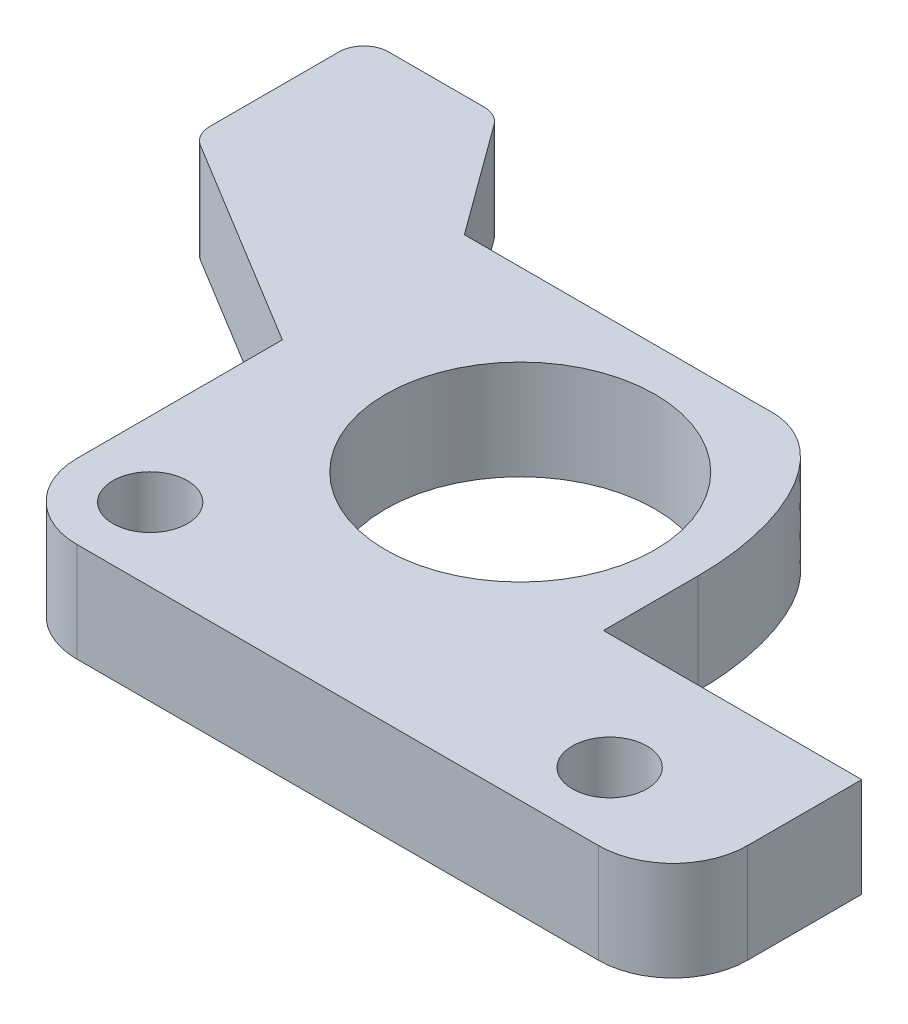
ISO-10303-21;
HEADER;
FILE_DESCRIPTION(('STEP AP214'),'2;1');
FILE_NAME('part.step','',(''),(''),'','','');
FILE_SCHEMA(('AUTOMOTIVE_DESIGN { 1 0 10303 214 1 1 1 1 }'));
ENDSEC;
DATA;
#1=APPLICATION_CONTEXT('core data for automotive mechanical design processes');
#2=APPLICATION_PROTOCOL_DEFINITION('international standard','automotive_design',2000,#1);
#3=PRODUCT_CONTEXT('',#1,'mechanical');
#4=PRODUCT('Part','Part','',(#3));
#5=PRODUCT_RELATED_PRODUCT_CATEGORY('part','',(#4));
#6=PRODUCT_DEFINITION_FORMATION('','',#4);
#7=PRODUCT_DEFINITION_CONTEXT('part definition',#1,'design');
#8=PRODUCT_DEFINITION('design','',#6,#7);
#9=PRODUCT_DEFINITION_SHAPE('','',#8);
#10=(LENGTH_UNIT() NAMED_UNIT(*) SI_UNIT(.MILLI.,.METRE.));
#11=(NAMED_UNIT(*) PLANE_ANGLE_UNIT() SI_UNIT($,.RADIAN.));
#12=(NAMED_UNIT(*) SI_UNIT($,.STERADIAN.) SOLID_ANGLE_UNIT());
#13=UNCERTAINTY_MEASURE_WITH_UNIT(LENGTH_MEASURE(1.E-05),#10,'distance_accuracy_value','');
#14=(GEOMETRIC_REPRESENTATION_CONTEXT(3) GLOBAL_UNCERTAINTY_ASSIGNED_CONTEXT((#13)) GLOBAL_UNIT_ASSIGNED_CONTEXT((#10,
#11,#12)) REPRESENTATION_CONTEXT('',''));
#15=CARTESIAN_POINT('',(0.,0.,0.));
#16=DIRECTION('',(0.,0.,1.));
#17=DIRECTION('',(1.,0.,0.));
#18=AXIS2_PLACEMENT_3D('',#15,#16,#17);
#19=CARTESIAN_POINT('',(-17.55,-2.,-7.725));
#20=DIRECTION('',(0.,1.,0.));
#21=DIRECTION('',(0.,0.,1.));
#22=AXIS2_PLACEMENT_3D('',#19,#20,#21);
#23=CYLINDRICAL_SURFACE('',#22,1.);
#24=DIRECTION('',(0.,1.,0.));
#25=VECTOR('',#24,1.);
#26=CARTESIAN_POINT('',(-16.7424340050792,-2.,-8.31477721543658));
#27=LINE('',#26,#25);
#28=CARTESIAN_POINT('',(-16.7424340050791,-2.,-8.31477721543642));
#29=VERTEX_POINT('',#28);
#30=CARTESIAN_POINT('',(-16.7424340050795,2.,-8.3147772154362));
#31=VERTEX_POINT('',#30);
#32=EDGE_CURVE('E131',#29,#31,#27,.T.);
#33=ORIENTED_EDGE('',*,*,#32,.F.);
#34=CARTESIAN_POINT('',(-17.55,-2.,-7.725));
#35=DIRECTION('',(0.,1.,0.));
#36=DIRECTION('',(0.,0.,1.));
#37=AXIS2_PLACEMENT_3D('',#34,#35,#36);
#38=CIRCLE('',#37,1.);
#39=CARTESIAN_POINT('',(-17.55,-2.,-8.725));
#40=VERTEX_POINT('',#39);
#41=EDGE_CURVE('E309',#29,#40,#38,.T.);
#42=ORIENTED_EDGE('',*,*,#41,.T.);
#43=DIRECTION('',(0.,1.,0.));
#44=VECTOR('',#43,1.);
#45=CARTESIAN_POINT('',(-17.55,-2.,-8.725));
#46=LINE('',#45,#44);
#47=CARTESIAN_POINT('',(-17.55,2.,-8.725));
#48=VERTEX_POINT('',#47);
#49=EDGE_CURVE('E134',#48,#40,#46,.F.);
#50=ORIENTED_EDGE('',*,*,#49,.F.);
#51=CARTESIAN_POINT('',(-17.55,2.,-7.725));
#52=DIRECTION('',(0.,1.,0.));
#53=DIRECTION('',(0.,0.,1.));
#54=AXIS2_PLACEMENT_3D('',#51,#52,#53);
#55=CIRCLE('',#54,1.);
#56=EDGE_CURVE('E20',#48,#31,#55,.F.);
#57=ORIENTED_EDGE('',*,*,#56,.T.);
#58=EDGE_LOOP('',(#33,#42,#50,#57));
#59=FACE_BOUND('',#58,.T.);
#60=ADVANCED_FACE('F17',(#59),#23,.T.);
#61=CARTESIAN_POINT('',(-21.4,-2.,-7.725));
#62=DIRECTION('',(0.,1.,0.));
#63=DIRECTION('',(0.,0.,1.));
#64=AXIS2_PLACEMENT_3D('',#61,#62,#63);
#65=CYLINDRICAL_SURFACE('',#64,1.);
#66=DIRECTION('',(0.,1.,0.));
#67=VECTOR('',#66,1.);
#68=CARTESIAN_POINT('',(-21.4,-2.,-8.725));
#69=LINE('',#68,#67);
#70=CARTESIAN_POINT('',(-21.4,-2.,-8.725));
#71=VERTEX_POINT('',#70);
#72=CARTESIAN_POINT('',(-21.4,2.,-8.725));
#73=VERTEX_POINT('',#72);
#74=EDGE_CURVE('E219',#71,#73,#69,.T.);
#75=ORIENTED_EDGE('',*,*,#74,.F.);
#76=CARTESIAN_POINT('',(-21.4,-2.,-7.725));
#77=DIRECTION('',(0.,1.,0.));
#78=DIRECTION('',(0.,0.,1.));
#79=AXIS2_PLACEMENT_3D('',#76,#77,#78);
#80=CIRCLE('',#79,1.);
#81=CARTESIAN_POINT('',(-22.4,-2.,-7.725));
#82=VERTEX_POINT('',#81);
#83=EDGE_CURVE('E382',#71,#82,#80,.T.);
#84=ORIENTED_EDGE('',*,*,#83,.T.);
#85=DIRECTION('',(0.,1.,0.));
#86=VECTOR('',#85,1.);
#87=CARTESIAN_POINT('',(-22.4,-2.,-7.725));
#88=LINE('',#87,#86);
#89=CARTESIAN_POINT('',(-22.4,2.,-7.725));
#90=VERTEX_POINT('',#89);
#91=EDGE_CURVE('E211',#90,#82,#88,.F.);
#92=ORIENTED_EDGE('',*,*,#91,.F.);
#93=CARTESIAN_POINT('',(-21.4,2.,-7.725));
#94=DIRECTION('',(0.,1.,0.));
#95=DIRECTION('',(0.,0.,1.));
#96=AXIS2_PLACEMENT_3D('',#93,#94,#95);
#97=CIRCLE('',#96,1.);
#98=EDGE_CURVE('E136',#90,#73,#97,.F.);
#99=ORIENTED_EDGE('',*,*,#98,.T.);
#100=EDGE_LOOP('',(#75,#84,#92,#99));
#101=FACE_BOUND('',#100,.T.);
#102=ADVANCED_FACE('F393',(#101),#65,.T.);
#103=CARTESIAN_POINT('',(-21.4,-2.,-2.525));
#104=DIRECTION('',(0.,1.,0.));
#105=DIRECTION('',(0.,0.,1.));
#106=AXIS2_PLACEMENT_3D('',#103,#104,#105);
#107=CYLINDRICAL_SURFACE('',#106,1.);
#108=DIRECTION('',(0.,1.,0.));
#109=VECTOR('',#108,1.);
#110=CARTESIAN_POINT('',(-22.4,-2.,-2.525));
#111=LINE('',#110,#109);
#112=CARTESIAN_POINT('',(-22.4,-2.,-2.525));
#113=VERTEX_POINT('',#112);
#114=CARTESIAN_POINT('',(-22.4,2.,-2.525));
#115=VERTEX_POINT('',#114);
#116=EDGE_CURVE('E214',#113,#115,#111,.T.);
#117=ORIENTED_EDGE('',*,*,#116,.F.);
#118=CARTESIAN_POINT('',(-21.4,-2.,-2.525));
#119=DIRECTION('',(0.,1.,0.));
#120=DIRECTION('',(0.,0.,1.));
#121=AXIS2_PLACEMENT_3D('',#118,#119,#120);
#122=CIRCLE('',#121,1.);
#123=CARTESIAN_POINT('',(-21.9199925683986,-2.,-1.67082921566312));
#124=VERTEX_POINT('',#123);
#125=EDGE_CURVE('E338',#113,#124,#122,.T.);
#126=ORIENTED_EDGE('',*,*,#125,.T.);
#127=DIRECTION('',(0.,1.,0.));
#128=VECTOR('',#127,1.);
#129=CARTESIAN_POINT('',(-21.9199925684,-2.,-1.670829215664));
#130=LINE('',#129,#128);
#131=CARTESIAN_POINT('',(-21.9199925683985,2.,-1.67082921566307));
#132=VERTEX_POINT('',#131);
#133=EDGE_CURVE('E207',#132,#124,#130,.F.);
#134=ORIENTED_EDGE('',*,*,#133,.F.);
#135=CARTESIAN_POINT('',(-21.4,2.,-2.525));
#136=DIRECTION('',(0.,1.,0.));
#137=DIRECTION('',(0.,0.,1.));
#138=AXIS2_PLACEMENT_3D('',#135,#136,#137);
#139=CIRCLE('',#138,1.);
#140=EDGE_CURVE('E370',#132,#115,#139,.F.);
#141=ORIENTED_EDGE('',*,*,#140,.T.);
#142=EDGE_LOOP('',(#117,#126,#134,#141));
#143=FACE_BOUND('',#142,.T.);
#144=ADVANCED_FACE('F378',(#143),#107,.T.);
#145=CARTESIAN_POINT('',(0.,-2.,0.));
#146=DIRECTION('',(0.,1.,0.));
#147=DIRECTION('',(0.,0.,1.));
#148=AXIS2_PLACEMENT_3D('',#145,#146,#147);
#149=PLANE('',#148);
#150=CARTESIAN_POINT('',(-4.1,-2.,3.275));
#151=DIRECTION('',(0.,1.,0.));
#152=DIRECTION('',(0.,0.,1.));
#153=AXIS2_PLACEMENT_3D('',#150,#151,#152);
#154=CIRCLE('',#153,5.425);
#155=CARTESIAN_POINT('',(-4.1,-2.,8.7));
#156=VERTEX_POINT('',#155);
#157=EDGE_CURVE('E169',#156,#156,#154,.T.);
#158=ORIENTED_EDGE('',*,*,#157,.T.);
#159=EDGE_LOOP('',(#158));
#160=FACE_BOUND('',#159,.T.);
#161=CARTESIAN_POINT('',(-10.5,-2.,11.775));
#162=DIRECTION('',(0.,1.,0.));
#163=DIRECTION('',(0.,0.,1.));
#164=AXIS2_PLACEMENT_3D('',#161,#162,#163);
#165=CIRCLE('',#164,1.5);
#166=CARTESIAN_POINT('',(-10.5,-2.,13.275));
#167=VERTEX_POINT('',#166);
#168=EDGE_CURVE('E554',#167,#167,#165,.T.);
#169=ORIENTED_EDGE('',*,*,#168,.T.);
#170=EDGE_LOOP('',(#169));
#171=FACE_BOUND('',#170,.T.);
#172=CARTESIAN_POINT('',(8.,-2.,11.775));
#173=DIRECTION('',(0.,1.,0.));
#174=DIRECTION('',(0.,0.,1.));
#175=AXIS2_PLACEMENT_3D('',#172,#173,#174);
#176=CIRCLE('',#175,1.5);
#177=CARTESIAN_POINT('',(8.,-2.,13.275));
#178=VERTEX_POINT('',#177);
#179=EDGE_CURVE('E343',#178,#178,#176,.T.);
#180=ORIENTED_EDGE('',*,*,#179,.T.);
#181=EDGE_LOOP('',(#180));
#182=FACE_BOUND('',#181,.T.);
#183=CARTESIAN_POINT('',(10.5,-2.,11.725));
#184=DIRECTION('',(0.,1.,0.));
#185=DIRECTION('',(0.,0.,1.));
#186=AXIS2_PLACEMENT_3D('',#183,#184,#185);
#187=CIRCLE('',#186,3.);
#188=CARTESIAN_POINT('',(10.5,-2.,14.725));
#189=VERTEX_POINT('',#188);
#190=CARTESIAN_POINT('',(13.5,-2.,11.725));
#191=VERTEX_POINT('',#190);
#192=EDGE_CURVE('E176',#189,#191,#187,.T.);
#193=ORIENTED_EDGE('',*,*,#192,.F.);
#194=DIRECTION('',(1.,0.,0.));
#195=VECTOR('',#194,1.);
#196=CARTESIAN_POINT('',(-10.5,-2.,14.725));
#197=LINE('',#196,#195);
#198=CARTESIAN_POINT('',(-10.5,-2.,14.725));
#199=VERTEX_POINT('',#198);
#200=EDGE_CURVE('E192',#199,#189,#197,.T.);
#201=ORIENTED_EDGE('',*,*,#200,.F.);
#202=CARTESIAN_POINT('',(-10.5,-2.,11.725));
#203=DIRECTION('',(0.,1.,0.));
#204=DIRECTION('',(0.,0.,1.));
#205=AXIS2_PLACEMENT_3D('',#202,#203,#204);
#206=CIRCLE('',#205,3.);
#207=CARTESIAN_POINT('',(-13.5,-2.,11.725));
#208=VERTEX_POINT('',#207);
#209=EDGE_CURVE('E196',#208,#199,#206,.T.);
#210=ORIENTED_EDGE('',*,*,#209,.F.);
#211=DIRECTION('',(0.,0.,1.));
#212=VECTOR('',#211,1.);
#213=CARTESIAN_POINT('',(-13.5,-2.,3.455));
#214=LINE('',#213,#212);
#215=CARTESIAN_POINT('',(-13.5000000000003,-2.,3.45500000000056));
#216=VERTEX_POINT('',#215);
#217=EDGE_CURVE('E200',#216,#208,#214,.T.);
#218=ORIENTED_EDGE('',*,*,#217,.F.);
#219=DIRECTION('',(0.854170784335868,0.,0.519992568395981));
#220=VECTOR('',#219,1.);
#221=CARTESIAN_POINT('',(-21.9199925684,-2.,-1.670829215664));
#222=LINE('',#221,#220);
#223=EDGE_CURVE('E204',#124,#216,#222,.T.);
#224=ORIENTED_EDGE('',*,*,#223,.F.);
#225=ORIENTED_EDGE('',*,*,#125,.F.);
#226=DIRECTION('',(0.,0.,1.));
#227=VECTOR('',#226,1.);
#228=CARTESIAN_POINT('',(-22.4,-2.,-7.725));
#229=LINE('',#228,#227);
#230=EDGE_CURVE('E210',#82,#113,#229,.T.);
#231=ORIENTED_EDGE('',*,*,#230,.F.);
#232=ORIENTED_EDGE('',*,*,#83,.F.);
#233=DIRECTION('',(-1.,0.,0.));
#234=VECTOR('',#233,1.);
#235=CARTESIAN_POINT('',(-17.55,-2.,-8.725));
#236=LINE('',#235,#234);
#237=EDGE_CURVE('E217',#40,#71,#236,.T.);
#238=ORIENTED_EDGE('',*,*,#237,.F.);
#239=ORIENTED_EDGE('',*,*,#41,.F.);
#240=DIRECTION('',(-0.589777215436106,0.,-0.807565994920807));
#241=VECTOR('',#240,1.);
#242=CARTESIAN_POINT('',(-13.5,-2.,-3.875));
#243=LINE('',#242,#241);
#244=CARTESIAN_POINT('',(-13.5,-2.,-3.875));
#245=VERTEX_POINT('',#244);
#246=EDGE_CURVE('E145',#245,#29,#243,.T.);
#247=ORIENTED_EDGE('',*,*,#246,.F.);
#248=DIRECTION('',(-1.,0.,0.));
#249=VECTOR('',#248,1.);
#250=CARTESIAN_POINT('',(-1.1,-2.,-3.875));
#251=LINE('',#250,#249);
#252=CARTESIAN_POINT('',(-1.10000021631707,-2.,-3.87509362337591));
#253=VERTEX_POINT('',#252);
#254=EDGE_CURVE('E147',#253,#245,#251,.T.);
#255=ORIENTED_EDGE('',*,*,#254,.F.);
#256=CARTESIAN_POINT('',(-1.10000043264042,-2.,-3.87518724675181));
#257=CARTESIAN_POINT('',(-1.06274442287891,-2.,-3.87528070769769));
#258=CARTESIAN_POINT('',(-1.02548448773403,-2.,-3.87452258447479));
#259=CARTESIAN_POINT('',(-0.95104595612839,-2.,-3.8712746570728));
#260=CARTESIAN_POINT('',(-0.913867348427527,-2.,-3.86878510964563));
#261=CARTESIAN_POINT('',(-0.839712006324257,-2.,-3.86204972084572));
#262=CARTESIAN_POINT('',(-0.802735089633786,-2.,-3.85780589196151));
#263=CARTESIAN_POINT('',(-0.729020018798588,-2.,-3.84759505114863));
#264=CARTESIAN_POINT('',(-0.692281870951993,-2.,-3.84162799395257));
#265=CARTESIAN_POINT('',(-0.619405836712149,-2.,-3.82812449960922));
#266=CARTESIAN_POINT('',(-0.583265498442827,-2.,-3.82060123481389));
#267=CARTESIAN_POINT('',(-0.511324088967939,-2.,-3.8040875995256));
#268=CARTESIAN_POINT('',(-0.475523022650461,-2.,-3.79509720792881));
#269=CARTESIAN_POINT('',(-0.368705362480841,-2.,-3.76590657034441));
#270=CARTESIAN_POINT('',(-0.298280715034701,-2.,-3.74348805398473));
#271=CARTESIAN_POINT('',(-0.159767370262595,-2.,-3.69318046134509));
#272=CARTESIAN_POINT('',(-0.091670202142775,-2.,-3.66531444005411));
#273=CARTESIAN_POINT('',(0.0423080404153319,-2.,-3.60472016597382));
#274=CARTESIAN_POINT('',(0.108189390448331,-2.,-3.57199252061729));
#275=CARTESIAN_POINT('',(0.237587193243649,-2.,-3.50186612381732));
#276=CARTESIAN_POINT('',(0.301098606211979,-2.,-3.46445808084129));
#277=CARTESIAN_POINT('',(0.425433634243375,-2.,-3.38541570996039));
#278=CARTESIAN_POINT('',(0.486256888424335,-2.,-3.34378081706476));
#279=CARTESIAN_POINT('',(0.643423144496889,-2.,-3.2287346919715));
#280=CARTESIAN_POINT('',(0.737427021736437,-2.,-3.15212099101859));
#281=CARTESIAN_POINT('',(0.918564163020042,-2.,-2.99114968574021));
#282=CARTESIAN_POINT('',(1.00569283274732,-2.,-2.90678698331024));
#283=CARTESIAN_POINT('',(1.17329028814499,-2.,-2.7313428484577));
#284=CARTESIAN_POINT('',(1.25374403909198,-2.,-2.64024707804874));
#285=CARTESIAN_POINT('',(1.40799057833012,-2.,-2.45265218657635));
#286=CARTESIAN_POINT('',(1.48178439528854,-2.,-2.35615390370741));
#287=CARTESIAN_POINT('',(1.66654289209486,-2.,-2.09822614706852));
#288=CARTESIAN_POINT('',(1.77257859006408,-2.,-1.93324018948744));
#289=CARTESIAN_POINT('',(1.92051166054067,-2.,-1.67936265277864));
#290=CARTESIAN_POINT('',(1.96798794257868,-2.,-1.59363074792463));
#291=CARTESIAN_POINT('',(2.05946658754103,-2.,-1.42033094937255));
#292=CARTESIAN_POINT('',(2.10346902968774,-2.,-1.33276309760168));
#293=CARTESIAN_POINT('',(2.2308021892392,-2.,-1.06703783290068));
#294=CARTESIAN_POINT('',(2.30911471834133,-2.,-0.886456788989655));
#295=CARTESIAN_POINT('',(2.4532245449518,-2.,-0.520457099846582));
#296=CARTESIAN_POINT('',(2.51902358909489,-2.,-0.335039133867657));
#297=CARTESIAN_POINT('',(2.63937629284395,-2.,0.0402199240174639));
#298=CARTESIAN_POINT('',(2.69388396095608,-2.,0.23007573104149));
#299=CARTESIAN_POINT('',(2.76763567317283,-2.,0.516929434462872));
#300=CARTESIAN_POINT('',(2.79089014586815,-2.,0.612920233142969));
#301=CARTESIAN_POINT('',(2.83485992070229,-2.,0.805484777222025));
#302=CARTESIAN_POINT('',(2.85557521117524,-2.,0.902058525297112));
#303=CARTESIAN_POINT('',(2.89449673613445,-2.,1.09574987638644));
#304=CARTESIAN_POINT('',(2.91270197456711,-2.,1.19286767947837));
#305=CARTESIAN_POINT('',(2.94655143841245,-2.,1.38754543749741));
#306=CARTESIAN_POINT('',(2.9621956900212,-2.,1.48510538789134));
#307=CARTESIAN_POINT('',(3.00481682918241,-2.,1.77519348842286));
#308=CARTESIAN_POINT('',(3.02811292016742,-2.,1.96827571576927));
#309=CARTESIAN_POINT('',(3.06492199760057,-2.,2.35523313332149));
#310=CARTESIAN_POINT('',(3.07844093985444,-2.,2.54910776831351));
#311=CARTESIAN_POINT('',(3.09614751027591,-2.,2.93699723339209));
#312=CARTESIAN_POINT('',(3.10034899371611,-2.,3.13101142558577));
#313=CARTESIAN_POINT('',(3.10012520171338,-2.,3.32500013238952));
#314=B_SPLINE_CURVE_WITH_KNOTS('',3,(#256,#257,#258,#259,#260,#261,#262,#263,#264,#265,#266,
#267,#268,#269,#270,#271,#272,#273,#274,#275,#276,#277,#278,#279,#280,#281,#282,#283,#284,#285,
#286,#287,#288,#289,#290,#291,#292,#293,#294,#295,#296,#297,#298,#299,#300,#301,#302,#303,#304,
#305,#306,#307,#308,#309,#310,#311,#312,#313),.UNSPECIFIED.,.F.,.F.,(4,2,2,2,2,2,2,2,2,2,2,2,2,
2,2,2,2,2,2,2,2,2,2,2,2,2,2,2,4),(0.,0.111761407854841,0.223506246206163,0.33512324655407,
0.446743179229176,0.55745437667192,0.668167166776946,0.889612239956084,1.11013964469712,
1.33063951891,1.5515842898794,1.77255863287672,2.13577978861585,2.49924164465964,
2.86350111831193,3.22770423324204,3.81506331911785,4.10900491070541,4.40293979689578,
4.99287384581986,5.58272549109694,6.17493439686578,6.47120927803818,6.7674855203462,
7.06387899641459,7.36026944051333,7.94343676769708,8.52624855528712,9.10819310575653),.UNSPECIFIED.);
#315=CARTESIAN_POINT('',(3.10006260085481,-2.,3.32500006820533));
#316=VERTEX_POINT('',#315);
#317=EDGE_CURVE('E299',#253,#316,#314,.T.);
#318=ORIENTED_EDGE('',*,*,#317,.T.);
#319=DIRECTION('',(0.,0.,-1.));
#320=VECTOR('',#319,1.);
#321=CARTESIAN_POINT('',(3.1,-2.,7.125));
#322=LINE('',#321,#320);
#323=CARTESIAN_POINT('',(3.1,-2.,7.125));
#324=VERTEX_POINT('',#323);
#325=EDGE_CURVE('E336',#324,#316,#322,.T.);
#326=ORIENTED_EDGE('',*,*,#325,.F.);
#327=DIRECTION('',(-1.,0.,0.));
#328=VECTOR('',#327,1.);
#329=CARTESIAN_POINT('',(13.5,-2.,7.125));
#330=LINE('',#329,#328);
#331=CARTESIAN_POINT('',(13.5,-2.,7.125));
#332=VERTEX_POINT('',#331);
#333=EDGE_CURVE('E185',#332,#324,#330,.T.);
#334=ORIENTED_EDGE('',*,*,#333,.F.);
#335=DIRECTION('',(0.,0.,-1.));
#336=VECTOR('',#335,1.);
#337=CARTESIAN_POINT('',(13.5,-2.,11.725));
#338=LINE('',#337,#336);
#339=EDGE_CURVE('E175',#191,#332,#338,.T.);
#340=ORIENTED_EDGE('',*,*,#339,.F.);
#341=EDGE_LOOP('',(#193,#201,#210,#218,#224,#225,#231,#232,#238,#239,#247,#255,#318,#326,#334,#340));
#342=FACE_BOUND('',#341,.T.);
#343=ADVANCED_FACE('F307',(#160,#171,#182,#342),#149,.F.);
#344=CARTESIAN_POINT('',(3.1,-2.,7.125));
#345=DIRECTION('',(1.,0.,0.));
#346=DIRECTION('',(0.,0.,-1.));
#347=AXIS2_PLACEMENT_3D('',#344,#345,#346);
#348=PLANE('',#347);
#349=DIRECTION('',(0.,1.,0.));
#350=VECTOR('',#349,1.);
#351=CARTESIAN_POINT('',(3.1,-2.,7.125));
#352=LINE('',#351,#350);
#353=CARTESIAN_POINT('',(3.1,2.,7.125));
#354=VERTEX_POINT('',#353);
#355=EDGE_CURVE('E186',#324,#354,#352,.T.);
#356=ORIENTED_EDGE('',*,*,#355,.F.);
#357=ORIENTED_EDGE('',*,*,#325,.T.);
#358=CARTESIAN_POINT('',(3.10012520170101,2.,3.32500014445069));
#359=DIRECTION('',(0.,-1.,0.));
#360=VECTOR('',#359,1.);
#361=LINE('',#358,#360);
#362=CARTESIAN_POINT('',(3.10006260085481,2.,3.32500006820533));
#363=VERTEX_POINT('',#362);
#364=EDGE_CURVE('E276',#316,#363,#361,.F.);
#365=ORIENTED_EDGE('',*,*,#364,.T.);
#366=DIRECTION('',(0.,0.,1.));
#367=VECTOR('',#366,1.);
#368=CARTESIAN_POINT('',(3.1,2.,0.));
#369=LINE('',#368,#367);
#370=EDGE_CURVE('E166',#354,#363,#369,.F.);
#371=ORIENTED_EDGE('',*,*,#370,.F.);
#372=EDGE_LOOP('',(#356,#357,#365,#371));
#373=FACE_BOUND('',#372,.T.);
#374=ADVANCED_FACE('F240',(#373),#348,.T.);
#375=CARTESIAN_POINT('',(-1.231925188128,-2.,-3.871447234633));
#376=CARTESIAN_POINT('',(-0.9793425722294,-2.,-3.885054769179));
#377=CARTESIAN_POINT('',(-0.5480026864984,-2.,-3.835776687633));
#378=CARTESIAN_POINT('',(0.1671233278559,-2.,-3.5843346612));
#379=CARTESIAN_POINT('',(0.8789441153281,-2.,-3.08136538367));
#380=CARTESIAN_POINT('',(1.561201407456,-2.,-2.299661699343));
#381=CARTESIAN_POINT('',(2.109111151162,-2.,-1.378755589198));
#382=CARTESIAN_POINT('',(2.541363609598,-2.,-0.3380127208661));
#383=CARTESIAN_POINT('',(2.967081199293,-2.,1.205706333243));
#384=CARTESIAN_POINT('',(3.116472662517,-2.,2.539531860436));
#385=CARTESIAN_POINT('',(3.097927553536,-2.,3.551157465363));
#386=(BOUNDED_CURVE() B_SPLINE_CURVE(3,(#375,#376,#377,#378,#379,#380,#381,#382,#383,#384,#385),
.UNSPECIFIED.,.F.,.F.) B_SPLINE_CURVE_WITH_KNOTS((4,1,1,1,1,1,1,1,4),(0.,0.0625,0.125,0.25,
0.375,0.5,0.625,0.75,1.),
.UNSPECIFIED.) CURVE() GEOMETRIC_REPRESENTATION_ITEM() RATIONAL_B_SPLINE_CURVE((1.,1.,1.,1.,1.,
1.,1.,1.,1.,1.,1.)) REPRESENTATION_ITEM(''));
#387=DIRECTION('',(0.,1.,0.));
#388=VECTOR('',#387,1.);
#389=SURFACE_OF_LINEAR_EXTRUSION('',#386,#388);
#390=CARTESIAN_POINT('',(3.10012520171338,2.,3.32500013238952));
#391=CARTESIAN_POINT('',(3.10023994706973,2.,3.21401935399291));
#392=CARTESIAN_POINT('',(3.09891964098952,2.,3.10304003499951));
#393=CARTESIAN_POINT('',(3.09330765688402,2.,2.88115205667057));
#394=CARTESIAN_POINT('',(3.08901584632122,2.,2.77024340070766));
#395=CARTESIAN_POINT('',(3.07149639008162,2.,2.43707391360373));
#396=CARTESIAN_POINT('',(3.05362275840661,2.,2.21503733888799));
#397=CARTESIAN_POINT('',(3.00492422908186,2.,1.77208092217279));
#398=CARTESIAN_POINT('',(2.97408224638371,2.,1.55116294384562));
#399=CARTESIAN_POINT('',(2.91782856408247,2.,1.22036913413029));
#400=CARTESIAN_POINT('',(2.89728352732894,2.,1.1096475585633));
#401=CARTESIAN_POINT('',(2.85292906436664,2.,0.888860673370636));
#402=CARTESIAN_POINT('',(2.82911961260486,2.,0.778795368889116));
#403=CARTESIAN_POINT('',(2.75274448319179,2.,0.449959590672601));
#404=CARTESIAN_POINT('',(2.69519298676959,2.,0.232318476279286));
#405=CARTESIAN_POINT('',(2.56543856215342,2.,-0.198347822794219));
#406=CARTESIAN_POINT('',(2.49325145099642,2.,-0.411377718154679));
#407=CARTESIAN_POINT('',(2.36063315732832,2.,-0.758436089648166));
#408=CARTESIAN_POINT('',(2.30481149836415,2.,-0.894232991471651));
#409=CARTESIAN_POINT('',(2.18590343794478,2.,-1.16262327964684));
#410=CARTESIAN_POINT('',(2.12281712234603,2.,-1.29521670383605));
#411=CARTESIAN_POINT('',(1.98907293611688,2.,-1.55634106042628));
#412=CARTESIAN_POINT('',(1.91842442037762,2.,-1.68487676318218));
#413=CARTESIAN_POINT('',(1.76875997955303,2.,-1.93698732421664));
#414=CARTESIAN_POINT('',(1.68974552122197,2.,-2.06056304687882));
#415=CARTESIAN_POINT('',(1.53542224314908,2.,-2.28340339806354));
#416=CARTESIAN_POINT('',(1.46135125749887,2.,-2.38352407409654));
#417=CARTESIAN_POINT('',(1.30633283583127,2.,-2.57836457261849));
#418=CARTESIAN_POINT('',(1.2253841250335,2.,-2.67308338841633));
#419=CARTESIAN_POINT('',(1.05639165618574,2.,-2.85570861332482));
#420=CARTESIAN_POINT('',(0.968359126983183,2.,-2.94362538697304));
#421=CARTESIAN_POINT('',(0.78512472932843,2.,-3.11162874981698));
#422=CARTESIAN_POINT('',(0.689927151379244,2.,-3.19171996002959));
#423=CARTESIAN_POINT('',(0.525403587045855,2.,-3.31617674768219));
#424=CARTESIAN_POINT('',(0.458268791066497,2.,-3.3634388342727));
#425=CARTESIAN_POINT('',(0.320633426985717,2.,-3.45278885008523));
#426=CARTESIAN_POINT('',(0.250133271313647,2.,-3.49487741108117));
#427=CARTESIAN_POINT('',(0.106221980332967,2.,-3.57323477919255));
#428=CARTESIAN_POINT('',(0.032819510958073,2.,-3.60951948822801));
#429=CARTESIAN_POINT('',(-0.116709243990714,2.,-3.67600291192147));
#430=CARTESIAN_POINT('',(-0.192835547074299,2.,-3.70620158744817));
#431=CARTESIAN_POINT('',(-0.336545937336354,2.,-3.75583070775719));
#432=CARTESIAN_POINT('',(-0.4038107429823,2.,-3.77618085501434));
#433=CARTESIAN_POINT('',(-0.505721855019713,2.,-3.80269468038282));
#434=CARTESIAN_POINT('',(-0.539858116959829,2.,-3.81086350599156));
#435=CARTESIAN_POINT('',(-0.608425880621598,2.,-3.82585875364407));
#436=CARTESIAN_POINT('',(-0.642857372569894,2.,-3.83268521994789));
#437=CARTESIAN_POINT('',(-0.712242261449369,2.,-3.84491262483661));
#438=CARTESIAN_POINT('',(-0.747197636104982,2.,-3.85030238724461));
#439=CARTESIAN_POINT('',(-0.817318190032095,2.,-3.85952072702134));
#440=CARTESIAN_POINT('',(-0.852483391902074,2.,-3.86334913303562));
#441=CARTESIAN_POINT('',(-0.923009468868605,2.,-3.86942479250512));
#442=CARTESIAN_POINT('',(-0.958370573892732,2.,-3.87166936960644));
#443=CARTESIAN_POINT('',(-1.02915576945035,2.,-3.87459438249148));
#444=CARTESIAN_POINT('',(-1.06457985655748,2.,-3.87527490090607));
#445=CARTESIAN_POINT('',(-1.10000043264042,2.,-3.87518724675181));
#446=B_SPLINE_CURVE_WITH_KNOTS('',3,(#390,#391,#392,#393,#394,#395,#396,#397,#398,#399,#400,
#401,#402,#403,#404,#405,#406,#407,#408,#409,#410,#411,#412,#413,#414,#415,#416,#417,#418,#419,
#420,#421,#422,#423,#424,#425,#426,#427,#428,#429,#430,#431,#432,#433,#434,#435,#436,#437,#438,
#439,#440,#441,#442,#443,#444,#445),.UNSPECIFIED.,.F.,.F.,(4,2,2,2,2,2,2,2,2,2,2,2,2,2,2,2,2,2,
2,2,2,2,2,2,2,2,2,4),(0.,0.332925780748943,0.665866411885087,1.33374827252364,2.0025127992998,
2.34030293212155,2.67809570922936,3.35298021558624,4.02713921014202,4.46742037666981,
4.90769634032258,5.34743381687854,5.78709432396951,6.16045828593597,6.53389160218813,
6.90674421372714,7.27937530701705,7.52547797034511,7.77155055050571,8.01693692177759,
8.26232487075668,8.47291910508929,8.57819742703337,8.68347227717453,8.78954362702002,
8.89562661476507,9.00188843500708,9.10814464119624),.UNSPECIFIED.);
#447=CARTESIAN_POINT('',(-1.10000021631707,2.,-3.87509362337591));
#448=VERTEX_POINT('',#447);
#449=EDGE_CURVE('E158',#363,#448,#446,.T.);
#450=ORIENTED_EDGE('',*,*,#449,.F.);
#451=ORIENTED_EDGE('',*,*,#364,.F.);
#452=ORIENTED_EDGE('',*,*,#317,.F.);
#453=CARTESIAN_POINT('',(-1.10000043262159,-2.,-3.87518724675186));
#454=DIRECTION('',(0.,1.,0.));
#455=VECTOR('',#454,1.);
#456=LINE('',#453,#455);
#457=EDGE_CURVE('E298',#448,#253,#456,.F.);
#458=ORIENTED_EDGE('',*,*,#457,.F.);
#459=EDGE_LOOP('',(#450,#451,#452,#458));
#460=FACE_BOUND('',#459,.T.);
#461=ADVANCED_FACE('F234',(#460),#389,.F.);
#462=CARTESIAN_POINT('',(-1.1,-2.,-3.875));
#463=DIRECTION('',(0.,0.,-1.));
#464=DIRECTION('',(-1.,0.,0.));
#465=AXIS2_PLACEMENT_3D('',#462,#463,#464);
#466=PLANE('',#465);
#467=ORIENTED_EDGE('',*,*,#457,.T.);
#468=ORIENTED_EDGE('',*,*,#254,.T.);
#469=DIRECTION('',(0.,1.,0.));
#470=VECTOR('',#469,1.);
#471=CARTESIAN_POINT('',(-13.5,-2.,-3.875));
#472=LINE('',#471,#470);
#473=CARTESIAN_POINT('',(-13.5,2.,-3.875));
#474=VERTEX_POINT('',#473);
#475=EDGE_CURVE('E146',#474,#245,#472,.F.);
#476=ORIENTED_EDGE('',*,*,#475,.F.);
#477=DIRECTION('',(1.,0.,0.));
#478=VECTOR('',#477,1.);
#479=CARTESIAN_POINT('',(0.,2.,-3.875));
#480=LINE('',#479,#478);
#481=EDGE_CURVE('E153',#448,#474,#480,.F.);
#482=ORIENTED_EDGE('',*,*,#481,.F.);
#483=EDGE_LOOP('',(#467,#468,#476,#482));
#484=FACE_BOUND('',#483,.T.);
#485=ADVANCED_FACE('F239',(#484),#466,.T.);
#486=CARTESIAN_POINT('',(-13.5,-2.,-3.875));
#487=DIRECTION('',(0.807565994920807,0.,-0.589777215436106));
#488=DIRECTION('',(-0.589777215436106,0.,-0.807565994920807));
#489=AXIS2_PLACEMENT_3D('',#486,#487,#488);
#490=PLANE('',#489);
#491=ORIENTED_EDGE('',*,*,#475,.T.);
#492=ORIENTED_EDGE('',*,*,#246,.T.);
#493=ORIENTED_EDGE('',*,*,#32,.T.);
#494=DIRECTION('',(-0.589777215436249,0.,-0.807565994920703));
#495=VECTOR('',#494,1.);
#496=CARTESIAN_POINT('',(-13.5,2.,-3.875));
#497=LINE('',#496,#495);
#498=EDGE_CURVE('E142',#474,#31,#497,.T.);
#499=ORIENTED_EDGE('',*,*,#498,.F.);
#500=EDGE_LOOP('',(#491,#492,#493,#499));
#501=FACE_BOUND('',#500,.T.);
#502=ADVANCED_FACE('F141',(#501),#490,.T.);
#503=CARTESIAN_POINT('',(-17.55,-2.,-8.725));
#504=DIRECTION('',(0.,0.,-1.));
#505=DIRECTION('',(-1.,0.,0.));
#506=AXIS2_PLACEMENT_3D('',#503,#504,#505);
#507=PLANE('',#506);
#508=ORIENTED_EDGE('',*,*,#49,.T.);
#509=ORIENTED_EDGE('',*,*,#237,.T.);
#510=ORIENTED_EDGE('',*,*,#74,.T.);
#511=DIRECTION('',(1.,0.,0.));
#512=VECTOR('',#511,1.);
#513=CARTESIAN_POINT('',(0.,2.,-8.725));
#514=LINE('',#513,#512);
#515=EDGE_CURVE('E154',#48,#73,#514,.F.);
#516=ORIENTED_EDGE('',*,*,#515,.F.);
#517=EDGE_LOOP('',(#508,#509,#510,#516));
#518=FACE_BOUND('',#517,.T.);
#519=ADVANCED_FACE('F395',(#518),#507,.T.);
#520=CARTESIAN_POINT('',(-22.4,-2.,-7.725));
#521=DIRECTION('',(-1.,0.,0.));
#522=DIRECTION('',(0.,0.,1.));
#523=AXIS2_PLACEMENT_3D('',#520,#521,#522);
#524=PLANE('',#523);
#525=ORIENTED_EDGE('',*,*,#91,.T.);
#526=ORIENTED_EDGE('',*,*,#230,.T.);
#527=ORIENTED_EDGE('',*,*,#116,.T.);
#528=DIRECTION('',(0.,0.,1.));
#529=VECTOR('',#528,1.);
#530=CARTESIAN_POINT('',(-22.4,2.,0.));
#531=LINE('',#530,#529);
#532=EDGE_CURVE('E156',#90,#115,#531,.T.);
#533=ORIENTED_EDGE('',*,*,#532,.F.);
#534=EDGE_LOOP('',(#525,#526,#527,#533));
#535=FACE_BOUND('',#534,.T.);
#536=ADVANCED_FACE('F374',(#535),#524,.T.);
#537=CARTESIAN_POINT('',(-21.9199925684,-2.,-1.670829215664));
#538=DIRECTION('',(-0.519992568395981,0.,0.854170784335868));
#539=DIRECTION('',(0.854170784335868,0.,0.519992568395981));
#540=AXIS2_PLACEMENT_3D('',#537,#538,#539);
#541=PLANE('',#540);
#542=ORIENTED_EDGE('',*,*,#133,.T.);
#543=ORIENTED_EDGE('',*,*,#223,.T.);
#544=DIRECTION('',(0.,1.,0.));
#545=VECTOR('',#544,1.);
#546=CARTESIAN_POINT('',(-13.5,-2.,3.455));
#547=LINE('',#546,#545);
#548=CARTESIAN_POINT('',(-13.5,2.,3.455));
#549=VERTEX_POINT('',#548);
#550=EDGE_CURVE('E201',#549,#216,#547,.F.);
#551=ORIENTED_EDGE('',*,*,#550,.F.);
#552=DIRECTION('',(0.854170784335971,0.,0.519992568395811));
#553=VECTOR('',#552,1.);
#554=CARTESIAN_POINT('',(-21.9199925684,2.,-1.670829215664));
#555=LINE('',#554,#553);
#556=EDGE_CURVE('E362',#132,#549,#555,.T.);
#557=ORIENTED_EDGE('',*,*,#556,.F.);
#558=EDGE_LOOP('',(#542,#543,#551,#557));
#559=FACE_BOUND('',#558,.T.);
#560=ADVANCED_FACE('F403',(#559),#541,.T.);
#561=CARTESIAN_POINT('',(-13.5,-2.,3.455));
#562=DIRECTION('',(-1.,0.,0.));
#563=DIRECTION('',(0.,0.,1.));
#564=AXIS2_PLACEMENT_3D('',#561,#562,#563);
#565=PLANE('',#564);
#566=ORIENTED_EDGE('',*,*,#550,.T.);
#567=ORIENTED_EDGE('',*,*,#217,.T.);
#568=DIRECTION('',(0.,1.,0.));
#569=VECTOR('',#568,1.);
#570=CARTESIAN_POINT('',(-13.5,-2.,11.725));
#571=LINE('',#570,#569);
#572=CARTESIAN_POINT('',(-13.5,2.,11.725));
#573=VERTEX_POINT('',#572);
#574=EDGE_CURVE('E197',#573,#208,#571,.F.);
#575=ORIENTED_EDGE('',*,*,#574,.F.);
#576=DIRECTION('',(0.,0.,1.));
#577=VECTOR('',#576,1.);
#578=CARTESIAN_POINT('',(-13.5,2.,0.));
#579=LINE('',#578,#577);
#580=EDGE_CURVE('E296',#549,#573,#579,.T.);
#581=ORIENTED_EDGE('',*,*,#580,.F.);
#582=EDGE_LOOP('',(#566,#567,#575,#581));
#583=FACE_BOUND('',#582,.T.);
#584=ADVANCED_FACE('F440',(#583),#565,.T.);
#585=CARTESIAN_POINT('',(-10.5,-2.,11.725));
#586=DIRECTION('',(0.,1.,0.));
#587=DIRECTION('',(0.,0.,1.));
#588=AXIS2_PLACEMENT_3D('',#585,#586,#587);
#589=CYLINDRICAL_SURFACE('',#588,3.);
#590=ORIENTED_EDGE('',*,*,#574,.T.);
#591=ORIENTED_EDGE('',*,*,#209,.T.);
#592=DIRECTION('',(0.,1.,0.));
#593=VECTOR('',#592,1.);
#594=CARTESIAN_POINT('',(-10.5,-2.,14.725));
#595=LINE('',#594,#593);
#596=CARTESIAN_POINT('',(-10.5,2.,14.725));
#597=VERTEX_POINT('',#596);
#598=EDGE_CURVE('E193',#597,#199,#595,.F.);
#599=ORIENTED_EDGE('',*,*,#598,.F.);
#600=CARTESIAN_POINT('',(-10.5,2.,11.725));
#601=DIRECTION('',(0.,1.,0.));
#602=DIRECTION('',(0.,0.,1.));
#603=AXIS2_PLACEMENT_3D('',#600,#601,#602);
#604=CIRCLE('',#603,3.);
#605=EDGE_CURVE('E294',#573,#597,#604,.T.);
#606=ORIENTED_EDGE('',*,*,#605,.F.);
#607=EDGE_LOOP('',(#590,#591,#599,#606));
#608=FACE_BOUND('',#607,.T.);
#609=ADVANCED_FACE('F436',(#608),#589,.T.);
#610=CARTESIAN_POINT('',(-10.5,-2.,14.725));
#611=DIRECTION('',(0.,0.,1.));
#612=DIRECTION('',(1.,0.,0.));
#613=AXIS2_PLACEMENT_3D('',#610,#611,#612);
#614=PLANE('',#613);
#615=ORIENTED_EDGE('',*,*,#598,.T.);
#616=ORIENTED_EDGE('',*,*,#200,.T.);
#617=DIRECTION('',(0.,1.,0.));
#618=VECTOR('',#617,1.);
#619=CARTESIAN_POINT('',(10.5,-2.,14.725));
#620=LINE('',#619,#618);
#621=CARTESIAN_POINT('',(10.5,2.,14.725));
#622=VERTEX_POINT('',#621);
#623=EDGE_CURVE('E189',#622,#189,#620,.F.);
#624=ORIENTED_EDGE('',*,*,#623,.F.);
#625=DIRECTION('',(1.,0.,0.));
#626=VECTOR('',#625,1.);
#627=CARTESIAN_POINT('',(0.,2.,14.725));
#628=LINE('',#627,#626);
#629=EDGE_CURVE('E293',#597,#622,#628,.T.);
#630=ORIENTED_EDGE('',*,*,#629,.F.);
#631=EDGE_LOOP('',(#615,#616,#624,#630));
#632=FACE_BOUND('',#631,.T.);
#633=ADVANCED_FACE('F432',(#632),#614,.T.);
#634=CARTESIAN_POINT('',(10.5,-2.,11.725));
#635=DIRECTION('',(0.,1.,0.));
#636=DIRECTION('',(0.,0.,1.));
#637=AXIS2_PLACEMENT_3D('',#634,#635,#636);
#638=CYLINDRICAL_SURFACE('',#637,3.);
#639=ORIENTED_EDGE('',*,*,#623,.T.);
#640=ORIENTED_EDGE('',*,*,#192,.T.);
#641=DIRECTION('',(0.,1.,0.));
#642=VECTOR('',#641,1.);
#643=CARTESIAN_POINT('',(13.5,-2.,11.725));
#644=LINE('',#643,#642);
#645=CARTESIAN_POINT('',(13.5,2.,11.725));
#646=VERTEX_POINT('',#645);
#647=EDGE_CURVE('E172',#646,#191,#644,.F.);
#648=ORIENTED_EDGE('',*,*,#647,.F.);
#649=CARTESIAN_POINT('',(10.5,2.,11.725));
#650=DIRECTION('',(0.,1.,0.));
#651=DIRECTION('',(0.,0.,1.));
#652=AXIS2_PLACEMENT_3D('',#649,#650,#651);
#653=CIRCLE('',#652,3.);
#654=EDGE_CURVE('E290',#622,#646,#653,.T.);
#655=ORIENTED_EDGE('',*,*,#654,.F.);
#656=EDGE_LOOP('',(#639,#640,#648,#655));
#657=FACE_BOUND('',#656,.T.);
#658=ADVANCED_FACE('F429',(#657),#638,.T.);
#659=CARTESIAN_POINT('',(13.5,-2.,11.725));
#660=DIRECTION('',(1.,0.,0.));
#661=DIRECTION('',(0.,0.,-1.));
#662=AXIS2_PLACEMENT_3D('',#659,#660,#661);
#663=PLANE('',#662);
#664=ORIENTED_EDGE('',*,*,#647,.T.);
#665=ORIENTED_EDGE('',*,*,#339,.T.);
#666=DIRECTION('',(0.,1.,0.));
#667=VECTOR('',#666,1.);
#668=CARTESIAN_POINT('',(13.5,-2.,7.125));
#669=LINE('',#668,#667);
#670=CARTESIAN_POINT('',(13.5,2.,7.125));
#671=VERTEX_POINT('',#670);
#672=EDGE_CURVE('E35',#671,#332,#669,.F.);
#673=ORIENTED_EDGE('',*,*,#672,.F.);
#674=DIRECTION('',(0.,0.,1.));
#675=VECTOR('',#674,1.);
#676=CARTESIAN_POINT('',(13.5,2.,0.));
#677=LINE('',#676,#675);
#678=EDGE_CURVE('E181',#646,#671,#677,.F.);
#679=ORIENTED_EDGE('',*,*,#678,.F.);
#680=EDGE_LOOP('',(#664,#665,#673,#679));
#681=FACE_BOUND('',#680,.T.);
#682=ADVANCED_FACE('F426',(#681),#663,.T.);
#683=CARTESIAN_POINT('',(13.5,-2.,7.125));
#684=DIRECTION('',(0.,0.,-1.));
#685=DIRECTION('',(-1.,0.,0.));
#686=AXIS2_PLACEMENT_3D('',#683,#684,#685);
#687=PLANE('',#686);
#688=ORIENTED_EDGE('',*,*,#672,.T.);
#689=ORIENTED_EDGE('',*,*,#333,.T.);
#690=ORIENTED_EDGE('',*,*,#355,.T.);
#691=DIRECTION('',(1.,0.,0.));
#692=VECTOR('',#691,1.);
#693=CARTESIAN_POINT('',(0.,2.,7.125));
#694=LINE('',#693,#692);
#695=EDGE_CURVE('E177',#671,#354,#694,.F.);
#696=ORIENTED_EDGE('',*,*,#695,.F.);
#697=EDGE_LOOP('',(#688,#689,#690,#696));
#698=FACE_BOUND('',#697,.T.);
#699=ADVANCED_FACE('F352',(#698),#687,.T.);
#700=CARTESIAN_POINT('',(8.,-2.,11.775));
#701=DIRECTION('',(0.,1.,0.));
#702=DIRECTION('',(0.,0.,1.));
#703=AXIS2_PLACEMENT_3D('',#700,#701,#702);
#704=CYLINDRICAL_SURFACE('',#703,1.5);
#705=CARTESIAN_POINT('',(8.,2.,11.775));
#706=DIRECTION('',(0.,1.,0.));
#707=DIRECTION('',(0.,0.,1.));
#708=AXIS2_PLACEMENT_3D('',#705,#706,#707);
#709=CIRCLE('',#708,1.5);
#710=CARTESIAN_POINT('',(8.,2.,13.275));
#711=VERTEX_POINT('',#710);
#712=EDGE_CURVE('E180',#711,#711,#709,.F.);
#713=ORIENTED_EDGE('',*,*,#712,.F.);
#714=EDGE_LOOP('',(#713));
#715=FACE_BOUND('',#714,.T.);
#716=ORIENTED_EDGE('',*,*,#179,.F.);
#717=EDGE_LOOP('',(#716));
#718=FACE_BOUND('',#717,.T.);
#719=ADVANCED_FACE('F419',(#715,#718),#704,.F.);
#720=CARTESIAN_POINT('',(-10.5,-2.,11.775));
#721=DIRECTION('',(0.,1.,0.));
#722=DIRECTION('',(0.,0.,1.));
#723=AXIS2_PLACEMENT_3D('',#720,#721,#722);
#724=CYLINDRICAL_SURFACE('',#723,1.5);
#725=CARTESIAN_POINT('',(-10.5,2.,11.775));
#726=DIRECTION('',(0.,1.,0.));
#727=DIRECTION('',(0.,0.,1.));
#728=AXIS2_PLACEMENT_3D('',#725,#726,#727);
#729=CIRCLE('',#728,1.5);
#730=CARTESIAN_POINT('',(-10.5,2.,13.275));
#731=VERTEX_POINT('',#730);
#732=EDGE_CURVE('E26',#731,#731,#729,.F.);
#733=ORIENTED_EDGE('',*,*,#732,.F.);
#734=EDGE_LOOP('',(#733));
#735=FACE_BOUND('',#734,.T.);
#736=ORIENTED_EDGE('',*,*,#168,.F.);
#737=EDGE_LOOP('',(#736));
#738=FACE_BOUND('',#737,.T.);
#739=ADVANCED_FACE('F411',(#735,#738),#724,.F.);
#740=CARTESIAN_POINT('',(-4.1,-2.,3.275));
#741=DIRECTION('',(0.,1.,0.));
#742=DIRECTION('',(0.,0.,1.));
#743=AXIS2_PLACEMENT_3D('',#740,#741,#742);
#744=CYLINDRICAL_SURFACE('',#743,5.425);
#745=CARTESIAN_POINT('',(-4.1,2.,3.275));
#746=DIRECTION('',(0.,1.,0.));
#747=DIRECTION('',(0.,0.,1.));
#748=AXIS2_PLACEMENT_3D('',#745,#746,#747);
#749=CIRCLE('',#748,5.425);
#750=CARTESIAN_POINT('',(-4.1,2.,8.7));
#751=VERTEX_POINT('',#750);
#752=EDGE_CURVE('E11',#751,#751,#749,.F.);
#753=ORIENTED_EDGE('',*,*,#752,.F.);
#754=EDGE_LOOP('',(#753));
#755=FACE_BOUND('',#754,.T.);
#756=ORIENTED_EDGE('',*,*,#157,.F.);
#757=EDGE_LOOP('',(#756));
#758=FACE_BOUND('',#757,.T.);
#759=ADVANCED_FACE('F406',(#755,#758),#744,.F.);
#760=CARTESIAN_POINT('',(0.,2.,0.));
#761=DIRECTION('',(0.,1.,0.));
#762=DIRECTION('',(0.,0.,1.));
#763=AXIS2_PLACEMENT_3D('',#760,#761,#762);
#764=PLANE('',#763);
#765=ORIENTED_EDGE('',*,*,#752,.T.);
#766=EDGE_LOOP('',(#765));
#767=FACE_BOUND('',#766,.T.);
#768=ORIENTED_EDGE('',*,*,#732,.T.);
#769=EDGE_LOOP('',(#768));
#770=FACE_BOUND('',#769,.T.);
#771=ORIENTED_EDGE('',*,*,#712,.T.);
#772=EDGE_LOOP('',(#771));
#773=FACE_BOUND('',#772,.T.);
#774=ORIENTED_EDGE('',*,*,#678,.T.);
#775=ORIENTED_EDGE('',*,*,#695,.T.);
#776=ORIENTED_EDGE('',*,*,#370,.T.);
#777=ORIENTED_EDGE('',*,*,#449,.T.);
#778=ORIENTED_EDGE('',*,*,#481,.T.);
#779=ORIENTED_EDGE('',*,*,#498,.T.);
#780=ORIENTED_EDGE('',*,*,#56,.F.);
#781=ORIENTED_EDGE('',*,*,#515,.T.);
#782=ORIENTED_EDGE('',*,*,#98,.F.);
#783=ORIENTED_EDGE('',*,*,#532,.T.);
#784=ORIENTED_EDGE('',*,*,#140,.F.);
#785=ORIENTED_EDGE('',*,*,#556,.T.);
#786=ORIENTED_EDGE('',*,*,#580,.T.);
#787=ORIENTED_EDGE('',*,*,#605,.T.);
#788=ORIENTED_EDGE('',*,*,#629,.T.);
#789=ORIENTED_EDGE('',*,*,#654,.T.);
#790=EDGE_LOOP('',(#774,#775,#776,#777,#778,#779,#780,#781,#782,#783,#784,#785,#786,#787,#788,#789));
#791=FACE_BOUND('',#790,.T.);
#792=ADVANCED_FACE('F150',(#767,#770,#773,#791),#764,.T.);
#793=CLOSED_SHELL('',(#60,#102,#144,#343,#374,#461,#485,#502,#519,#536,#560,#584,#609,#633,#658,
#682,#699,#719,#739,#759,#792));
#794=MANIFOLD_SOLID_BREP('B1',#793);
#795=ADVANCED_BREP_SHAPE_REPRESENTATION('',(#18,#794),#14);
#796=SHAPE_DEFINITION_REPRESENTATION(#9,#795);
ENDSEC;
END-ISO-10303-21;
